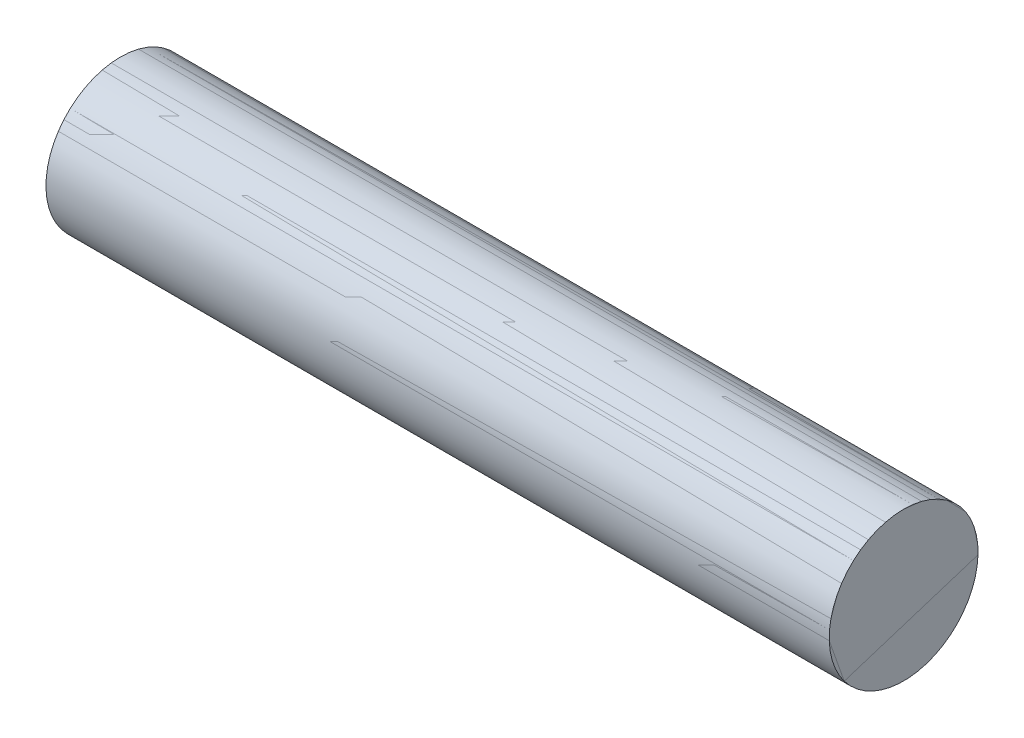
ISO-10303-21;
HEADER;
FILE_DESCRIPTION(('STEP AP214'),'2;1');
FILE_NAME('part.step','',(''),(''),'','','');
FILE_SCHEMA(('AUTOMOTIVE_DESIGN { 1 0 10303 214 1 1 1 1 }'));
ENDSEC;
DATA;
#1=APPLICATION_CONTEXT('core data for automotive mechanical design processes');
#2=APPLICATION_PROTOCOL_DEFINITION('international standard','automotive_design',2000,#1);
#3=PRODUCT_CONTEXT('',#1,'mechanical');
#4=PRODUCT('Part','Part','',(#3));
#5=PRODUCT_RELATED_PRODUCT_CATEGORY('part','',(#4));
#6=PRODUCT_DEFINITION_FORMATION('','',#4);
#7=PRODUCT_DEFINITION_CONTEXT('part definition',#1,'design');
#8=PRODUCT_DEFINITION('design','',#6,#7);
#9=PRODUCT_DEFINITION_SHAPE('','',#8);
#10=(LENGTH_UNIT() NAMED_UNIT(*) SI_UNIT(.MILLI.,.METRE.));
#11=(NAMED_UNIT(*) PLANE_ANGLE_UNIT() SI_UNIT($,.RADIAN.));
#12=(NAMED_UNIT(*) SI_UNIT($,.STERADIAN.) SOLID_ANGLE_UNIT());
#13=UNCERTAINTY_MEASURE_WITH_UNIT(LENGTH_MEASURE(1.E-05),#10,'distance_accuracy_value','');
#14=(GEOMETRIC_REPRESENTATION_CONTEXT(3) GLOBAL_UNCERTAINTY_ASSIGNED_CONTEXT((#13)) GLOBAL_UNIT_ASSIGNED_CONTEXT((#10,
#11,#12)) REPRESENTATION_CONTEXT('',''));
#15=CARTESIAN_POINT('',(0.,0.,0.));
#16=DIRECTION('',(0.,0.,1.));
#17=DIRECTION('',(1.,0.,0.));
#18=AXIS2_PLACEMENT_3D('',#15,#16,#17);
#19=CARTESIAN_POINT('',(-5.,1.29156803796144,20.7084319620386));
#20=DIRECTION('',(-1.,0.,0.));
#21=DIRECTION('',(0.,-1.,0.));
#22=AXIS2_PLACEMENT_3D('',#19,#20,#21);
#23=PLANE('',#22);
#24=CARTESIAN_POINT('',(-5.,0.,22.));
#25=DIRECTION('',(1.,0.,0.));
#26=DIRECTION('',(0.,1.,0.));
#27=AXIS2_PLACEMENT_3D('',#24,#25,#26);
#28=CIRCLE('',#27,0.949999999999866);
#29=CARTESIAN_POINT('',(-5.,0.949999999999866,22.));
#30=VERTEX_POINT('',#29);
#31=EDGE_CURVE('P0_E356',#30,#30,#28,.F.);
#32=ORIENTED_EDGE('',*,*,#31,.T.);
#33=EDGE_LOOP('',(#32));
#34=FACE_BOUND('',#33,.T.);
#35=ADVANCED_FACE('P0_F348',(#34),#23,.T.);
#36=CARTESIAN_POINT('',(-5.,0.,22.));
#37=DIRECTION('',(1.,0.,0.));
#38=DIRECTION('',(0.,1.,0.));
#39=AXIS2_PLACEMENT_3D('',#36,#37,#38);
#40=CYLINDRICAL_SURFACE('',#39,0.949999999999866);
#41=ORIENTED_EDGE('',*,*,#31,.F.);
#42=EDGE_LOOP('',(#41));
#43=FACE_BOUND('',#42,.T.);
#44=CARTESIAN_POINT('',(5.,0.,22.));
#45=DIRECTION('',(1.,0.,0.));
#46=DIRECTION('',(0.,1.,0.));
#47=AXIS2_PLACEMENT_3D('',#44,#45,#46);
#48=CIRCLE('',#47,0.949999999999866);
#49=CARTESIAN_POINT('',(5.,0.94999999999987,22.));
#50=VERTEX_POINT('',#49);
#51=EDGE_CURVE('P0_E10',#50,#50,#48,.T.);
#52=ORIENTED_EDGE('',*,*,#51,.F.);
#53=EDGE_LOOP('',(#52));
#54=FACE_BOUND('',#53,.T.);
#55=ADVANCED_FACE('P0_F366',(#43,#54),#40,.T.);
#56=CARTESIAN_POINT('',(5.,-1.29156803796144,20.7084319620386));
#57=DIRECTION('',(1.,0.,0.));
#58=DIRECTION('',(0.,1.,0.));
#59=AXIS2_PLACEMENT_3D('',#56,#57,#58);
#60=PLANE('',#59);
#61=ORIENTED_EDGE('',*,*,#51,.T.);
#62=EDGE_LOOP('',(#61));
#63=FACE_BOUND('',#62,.T.);
#64=ADVANCED_FACE('P0_F350',(#63),#60,.T.);
#65=CLOSED_SHELL('',(#35,#55,#64));
#66=MANIFOLD_SOLID_BREP('P0_B2',#65);
#67=CARTESIAN_POINT('',(-5.,1.29156803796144,20.7084319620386));
#68=DIRECTION('',(-1.,0.,0.));
#69=DIRECTION('',(0.,-1.,0.));
#70=AXIS2_PLACEMENT_3D('',#67,#68,#69);
#71=PLANE('',#70);
#72=CARTESIAN_POINT('',(-5.,0.,22.));
#73=DIRECTION('',(1.,0.,0.));
#74=DIRECTION('',(0.,1.,0.));
#75=AXIS2_PLACEMENT_3D('',#72,#73,#74);
#76=CIRCLE('',#75,0.949999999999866);
#77=CARTESIAN_POINT('',(-5.,0.949999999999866,22.));
#78=VERTEX_POINT('',#77);
#79=EDGE_CURVE('P1_E22',#78,#78,#76,.F.);
#80=ORIENTED_EDGE('',*,*,#79,.T.);
#81=EDGE_LOOP('',(#80));
#82=FACE_BOUND('',#81,.T.);
#83=ADVANCED_FACE('P1_F14',(#82),#71,.T.);
#84=CARTESIAN_POINT('',(-5.,0.,22.));
#85=DIRECTION('',(1.,0.,0.));
#86=DIRECTION('',(0.,1.,0.));
#87=AXIS2_PLACEMENT_3D('',#84,#85,#86);
#88=CYLINDRICAL_SURFACE('',#87,0.949999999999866);
#89=ORIENTED_EDGE('',*,*,#79,.F.);
#90=EDGE_LOOP('',(#89));
#91=FACE_BOUND('',#90,.T.);
#92=CARTESIAN_POINT('',(5.,0.,22.));
#93=DIRECTION('',(1.,0.,0.));
#94=DIRECTION('',(0.,1.,0.));
#95=AXIS2_PLACEMENT_3D('',#92,#93,#94);
#96=CIRCLE('',#95,0.949999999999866);
#97=CARTESIAN_POINT('',(5.,0.94999999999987,22.));
#98=VERTEX_POINT('',#97);
#99=EDGE_CURVE('P1_E9',#98,#98,#96,.T.);
#100=ORIENTED_EDGE('',*,*,#99,.F.);
#101=EDGE_LOOP('',(#100));
#102=FACE_BOUND('',#101,.T.);
#103=ADVANCED_FACE('P1_F32',(#91,#102),#88,.T.);
#104=CARTESIAN_POINT('',(5.,-1.29156803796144,20.7084319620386));
#105=DIRECTION('',(1.,0.,0.));
#106=DIRECTION('',(0.,1.,0.));
#107=AXIS2_PLACEMENT_3D('',#104,#105,#106);
#108=PLANE('',#107);
#109=ORIENTED_EDGE('',*,*,#99,.T.);
#110=EDGE_LOOP('',(#109));
#111=FACE_BOUND('',#110,.T.);
#112=ADVANCED_FACE('P1_F16',(#111),#108,.T.);
#113=CLOSED_SHELL('',(#83,#103,#112));
#114=MANIFOLD_SOLID_BREP('P1_B1',#113);
#115=ADVANCED_BREP_SHAPE_REPRESENTATION('',(#18,#66,#114),#14);
#116=SHAPE_DEFINITION_REPRESENTATION(#9,#115);
ENDSEC;
END-ISO-10303-21;
